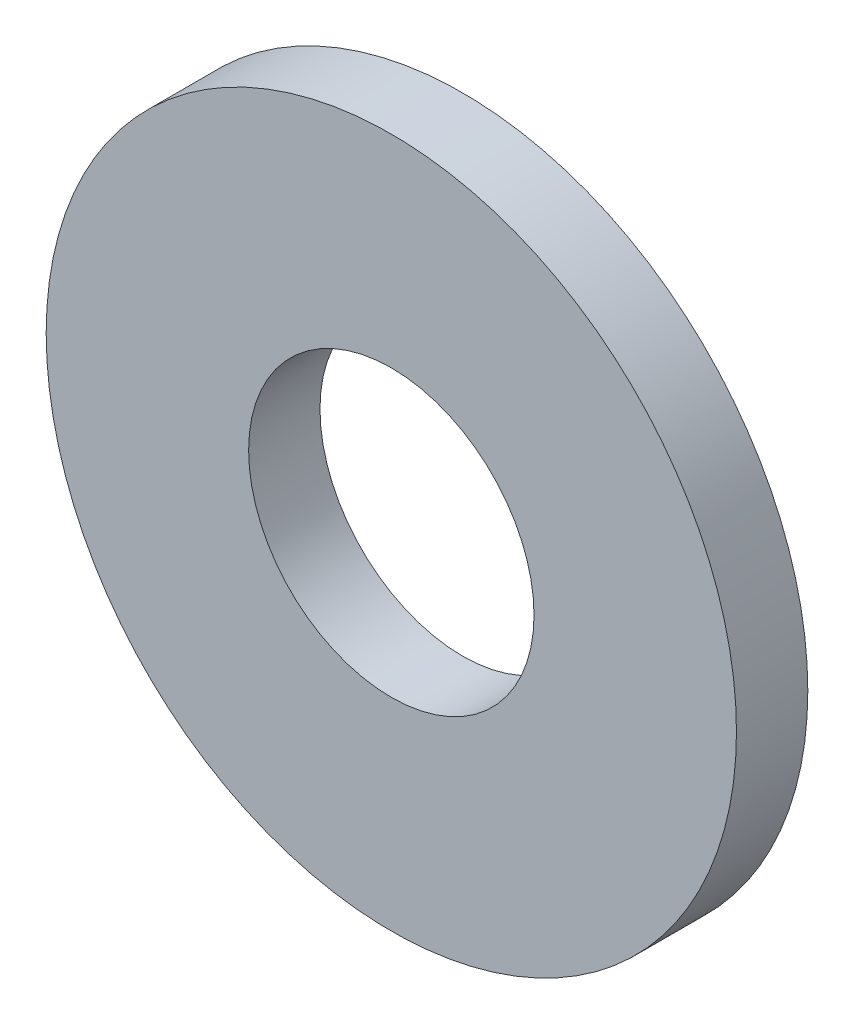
from build123d import *

# Parameters (mm, degrees)
SKETCH1_R           = 4.9149
SKETCH1_R_2         = 2.032
BOSS_EXTRUDE1_DEPTH = 1.016


with BuildPart() as part:
    # Sketch1 → Boss-Extrude1 (new body)
    with BuildSketch(Plane.XY):
        Circle(SKETCH1_R)
        Circle(SKETCH1_R_2, mode=Mode.SUBTRACT)
    extrude(amount=BOSS_EXTRUDE1_DEPTH)


solid = part.part
